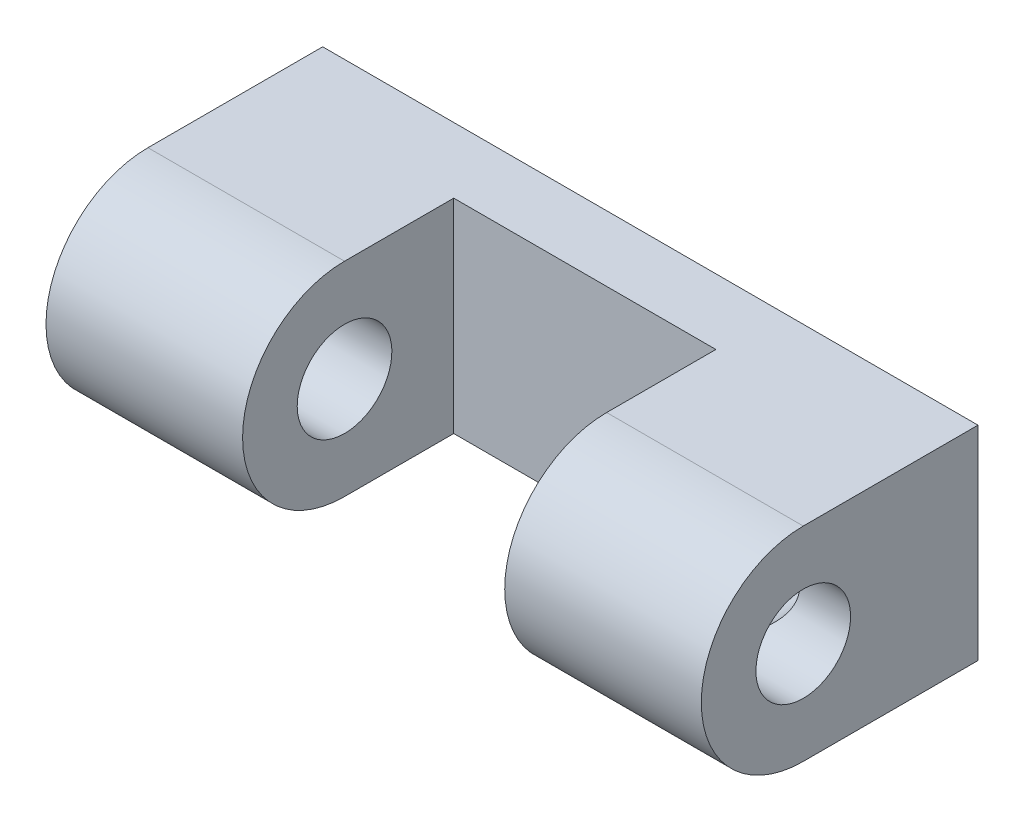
ISO-10303-21;
HEADER;
FILE_DESCRIPTION(('STEP AP214'),'2;1');
FILE_NAME('part.step','',(''),(''),'','','');
FILE_SCHEMA(('AUTOMOTIVE_DESIGN { 1 0 10303 214 1 1 1 1 }'));
ENDSEC;
DATA;
#1=APPLICATION_CONTEXT('core data for automotive mechanical design processes');
#2=APPLICATION_PROTOCOL_DEFINITION('international standard','automotive_design',2000,#1);
#3=PRODUCT_CONTEXT('',#1,'mechanical');
#4=PRODUCT('Part','Part','',(#3));
#5=PRODUCT_RELATED_PRODUCT_CATEGORY('part','',(#4));
#6=PRODUCT_DEFINITION_FORMATION('','',#4);
#7=PRODUCT_DEFINITION_CONTEXT('part definition',#1,'design');
#8=PRODUCT_DEFINITION('design','',#6,#7);
#9=PRODUCT_DEFINITION_SHAPE('','',#8);
#10=(LENGTH_UNIT() NAMED_UNIT(*) SI_UNIT(.MILLI.,.METRE.));
#11=(NAMED_UNIT(*) PLANE_ANGLE_UNIT() SI_UNIT($,.RADIAN.));
#12=(NAMED_UNIT(*) SI_UNIT($,.STERADIAN.) SOLID_ANGLE_UNIT());
#13=UNCERTAINTY_MEASURE_WITH_UNIT(LENGTH_MEASURE(1.E-05),#10,'distance_accuracy_value','');
#14=(GEOMETRIC_REPRESENTATION_CONTEXT(3) GLOBAL_UNCERTAINTY_ASSIGNED_CONTEXT((#13)) GLOBAL_UNIT_ASSIGNED_CONTEXT((#10,
#11,#12)) REPRESENTATION_CONTEXT('',''));
#15=CARTESIAN_POINT('',(0.,0.,0.));
#16=DIRECTION('',(0.,0.,1.));
#17=DIRECTION('',(1.,0.,0.));
#18=AXIS2_PLACEMENT_3D('',#15,#16,#17);
#19=CARTESIAN_POINT('',(38.5,0.,12.));
#20=DIRECTION('',(-1.,0.,0.));
#21=DIRECTION('',(0.,-1.,0.));
#22=AXIS2_PLACEMENT_3D('',#19,#20,#21);
#23=CYLINDRICAL_SURFACE('',#22,7.);
#24=CARTESIAN_POINT('',(25.,0.,12.));
#25=DIRECTION('',(-1.,0.,0.));
#26=DIRECTION('',(0.,0.,1.));
#27=AXIS2_PLACEMENT_3D('',#24,#25,#26);
#28=CIRCLE('',#27,7.);
#29=CARTESIAN_POINT('',(25.,-7.,12.));
#30=VERTEX_POINT('',#29);
#31=CARTESIAN_POINT('',(25.,7.,12.));
#32=VERTEX_POINT('',#31);
#33=EDGE_CURVE('E83',#30,#32,#28,.T.);
#34=ORIENTED_EDGE('',*,*,#33,.F.);
#35=DIRECTION('',(-1.,0.,0.));
#36=VECTOR('',#35,1.);
#37=CARTESIAN_POINT('',(38.5,-7.,12.));
#38=LINE('',#37,#36);
#39=CARTESIAN_POINT('',(38.5,-7.,12.));
#40=VERTEX_POINT('',#39);
#41=EDGE_CURVE('E10',#40,#30,#38,.T.);
#42=ORIENTED_EDGE('',*,*,#41,.F.);
#43=CARTESIAN_POINT('',(38.5,0.,12.));
#44=DIRECTION('',(1.,0.,0.));
#45=DIRECTION('',(0.,1.,0.));
#46=AXIS2_PLACEMENT_3D('',#43,#44,#45);
#47=CIRCLE('',#46,7.);
#48=CARTESIAN_POINT('',(38.5,7.,12.));
#49=VERTEX_POINT('',#48);
#50=EDGE_CURVE('E99',#49,#40,#47,.T.);
#51=ORIENTED_EDGE('',*,*,#50,.F.);
#52=DIRECTION('',(-1.,0.,0.));
#53=VECTOR('',#52,1.);
#54=CARTESIAN_POINT('',(38.5,7.,12.));
#55=LINE('',#54,#53);
#56=EDGE_CURVE('E39',#49,#32,#55,.T.);
#57=ORIENTED_EDGE('',*,*,#56,.T.);
#58=EDGE_LOOP('',(#34,#42,#51,#57));
#59=FACE_BOUND('',#58,.T.);
#60=ADVANCED_FACE('F16',(#59),#23,.T.);
#61=CARTESIAN_POINT('',(38.5,-7.,12.));
#62=DIRECTION('',(0.,1.,0.));
#63=DIRECTION('',(0.,0.,1.));
#64=AXIS2_PLACEMENT_3D('',#61,#62,#63);
#65=PLANE('',#64);
#66=DIRECTION('',(0.,0.,1.));
#67=VECTOR('',#66,1.);
#68=CARTESIAN_POINT('',(25.,-7.,4.5));
#69=LINE('',#68,#67);
#70=CARTESIAN_POINT('',(25.,-7.,4.5));
#71=VERTEX_POINT('',#70);
#72=EDGE_CURVE('E89',#71,#30,#69,.T.);
#73=ORIENTED_EDGE('',*,*,#72,.F.);
#74=DIRECTION('',(-1.,0.,0.));
#75=VECTOR('',#74,1.);
#76=CARTESIAN_POINT('',(25.,-7.,4.5));
#77=LINE('',#76,#75);
#78=CARTESIAN_POINT('',(7.,-7.,4.5));
#79=VERTEX_POINT('',#78);
#80=EDGE_CURVE('E148',#71,#79,#77,.T.);
#81=ORIENTED_EDGE('',*,*,#80,.T.);
#82=DIRECTION('',(0.,0.,1.));
#83=VECTOR('',#82,1.);
#84=CARTESIAN_POINT('',(7.,-7.,4.5));
#85=LINE('',#84,#83);
#86=CARTESIAN_POINT('',(7.,-7.,12.));
#87=VERTEX_POINT('',#86);
#88=EDGE_CURVE('E91',#79,#87,#85,.T.);
#89=ORIENTED_EDGE('',*,*,#88,.T.);
#90=CARTESIAN_POINT('',(-6.5,-7.,12.));
#91=VERTEX_POINT('',#90);
#92=EDGE_CURVE('E24',#87,#91,#38,.T.);
#93=ORIENTED_EDGE('',*,*,#92,.T.);
#94=DIRECTION('',(0.,0.,-1.));
#95=VECTOR('',#94,1.);
#96=CARTESIAN_POINT('',(-6.5,-7.,12.));
#97=LINE('',#96,#95);
#98=CARTESIAN_POINT('',(-6.5,-7.,0.));
#99=VERTEX_POINT('',#98);
#100=EDGE_CURVE('E117',#91,#99,#97,.T.);
#101=ORIENTED_EDGE('',*,*,#100,.T.);
#102=DIRECTION('',(-1.,0.,0.));
#103=VECTOR('',#102,1.);
#104=CARTESIAN_POINT('',(38.5,-7.,0.));
#105=LINE('',#104,#103);
#106=CARTESIAN_POINT('',(38.5,-7.,0.));
#107=VERTEX_POINT('',#106);
#108=EDGE_CURVE('E104',#107,#99,#105,.T.);
#109=ORIENTED_EDGE('',*,*,#108,.F.);
#110=DIRECTION('',(0.,0.,-1.));
#111=VECTOR('',#110,1.);
#112=CARTESIAN_POINT('',(38.5,-7.,12.));
#113=LINE('',#112,#111);
#114=EDGE_CURVE('E140',#40,#107,#113,.T.);
#115=ORIENTED_EDGE('',*,*,#114,.F.);
#116=ORIENTED_EDGE('',*,*,#41,.T.);
#117=EDGE_LOOP('',(#73,#81,#89,#93,#101,#109,#115,#116));
#118=FACE_BOUND('',#117,.T.);
#119=ADVANCED_FACE('F18',(#118),#65,.F.);
#120=CARTESIAN_POINT('',(38.5,7.,12.));
#121=DIRECTION('',(0.,1.,0.));
#122=DIRECTION('',(0.,0.,1.));
#123=AXIS2_PLACEMENT_3D('',#120,#121,#122);
#124=PLANE('',#123);
#125=DIRECTION('',(-1.,0.,0.));
#126=VECTOR('',#125,1.);
#127=CARTESIAN_POINT('',(25.,7.,4.5));
#128=LINE('',#127,#126);
#129=CARTESIAN_POINT('',(25.,7.,4.5));
#130=VERTEX_POINT('',#129);
#131=CARTESIAN_POINT('',(7.,7.,4.5));
#132=VERTEX_POINT('',#131);
#133=EDGE_CURVE('E95',#130,#132,#128,.T.);
#134=ORIENTED_EDGE('',*,*,#133,.F.);
#135=DIRECTION('',(0.,0.,-1.));
#136=VECTOR('',#135,1.);
#137=CARTESIAN_POINT('',(25.,7.,12.));
#138=LINE('',#137,#136);
#139=EDGE_CURVE('E86',#32,#130,#138,.T.);
#140=ORIENTED_EDGE('',*,*,#139,.F.);
#141=ORIENTED_EDGE('',*,*,#56,.F.);
#142=DIRECTION('',(0.,0.,-1.));
#143=VECTOR('',#142,1.);
#144=CARTESIAN_POINT('',(38.5,7.,12.));
#145=LINE('',#144,#143);
#146=CARTESIAN_POINT('',(38.5,7.,0.));
#147=VERTEX_POINT('',#146);
#148=EDGE_CURVE('E106',#49,#147,#145,.T.);
#149=ORIENTED_EDGE('',*,*,#148,.T.);
#150=DIRECTION('',(-1.,0.,0.));
#151=VECTOR('',#150,1.);
#152=CARTESIAN_POINT('',(38.5,7.,0.));
#153=LINE('',#152,#151);
#154=CARTESIAN_POINT('',(-6.5,7.,0.));
#155=VERTEX_POINT('',#154);
#156=EDGE_CURVE('E101',#147,#155,#153,.T.);
#157=ORIENTED_EDGE('',*,*,#156,.T.);
#158=DIRECTION('',(0.,0.,-1.));
#159=VECTOR('',#158,1.);
#160=CARTESIAN_POINT('',(-6.5,7.,12.));
#161=LINE('',#160,#159);
#162=CARTESIAN_POINT('',(-6.5,7.,12.));
#163=VERTEX_POINT('',#162);
#164=EDGE_CURVE('E134',#163,#155,#161,.T.);
#165=ORIENTED_EDGE('',*,*,#164,.F.);
#166=CARTESIAN_POINT('',(7.,7.,12.));
#167=VERTEX_POINT('',#166);
#168=EDGE_CURVE('E102',#167,#163,#55,.T.);
#169=ORIENTED_EDGE('',*,*,#168,.F.);
#170=DIRECTION('',(0.,0.,-1.));
#171=VECTOR('',#170,1.);
#172=CARTESIAN_POINT('',(7.,7.,12.));
#173=LINE('',#172,#171);
#174=EDGE_CURVE('E155',#167,#132,#173,.T.);
#175=ORIENTED_EDGE('',*,*,#174,.T.);
#176=EDGE_LOOP('',(#134,#140,#141,#149,#157,#165,#169,#175));
#177=FACE_BOUND('',#176,.T.);
#178=ADVANCED_FACE('F93',(#177),#124,.T.);
#179=CARTESIAN_POINT('',(38.5,0.,12.));
#180=DIRECTION('',(-1.,0.,0.));
#181=DIRECTION('',(0.,-1.,0.));
#182=AXIS2_PLACEMENT_3D('',#179,#180,#181);
#183=CYLINDRICAL_SURFACE('',#182,3.25);
#184=CARTESIAN_POINT('',(38.5,0.,12.));
#185=DIRECTION('',(-1.,0.,0.));
#186=DIRECTION('',(0.,-1.,0.));
#187=AXIS2_PLACEMENT_3D('',#184,#185,#186);
#188=CIRCLE('',#187,3.25);
#189=CARTESIAN_POINT('',(38.5,-3.25,12.));
#190=VERTEX_POINT('',#189);
#191=EDGE_CURVE('E129',#190,#190,#188,.T.);
#192=ORIENTED_EDGE('',*,*,#191,.F.);
#193=EDGE_LOOP('',(#192));
#194=FACE_BOUND('',#193,.T.);
#195=CARTESIAN_POINT('',(29.,0.,8.75));
#196=CARTESIAN_POINT('',(28.9999981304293,-0.0689412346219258,8.74999814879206));
#197=CARTESIAN_POINT('',(29.0023812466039,-0.137864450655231,8.7521985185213));
#198=CARTESIAN_POINT('',(29.0118484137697,-0.275116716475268,8.76093424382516));
#199=CARTESIAN_POINT('',(29.0189335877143,-0.343445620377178,8.76747063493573));
#200=CARTESIAN_POINT('',(29.0470833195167,-0.546758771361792,8.79341938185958));
#201=CARTESIAN_POINT('',(29.0750421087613,-0.680077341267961,8.81917133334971));
#202=CARTESIAN_POINT('',(29.1470544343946,-0.937275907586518,8.88526131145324));
#203=CARTESIAN_POINT('',(29.1910020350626,-1.06121168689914,8.92550331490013));
#204=CARTESIAN_POINT('',(29.2925061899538,-1.29851679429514,9.0179562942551));
#205=CARTESIAN_POINT('',(29.3500677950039,-1.4118821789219,9.07017171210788));
#206=CARTESIAN_POINT('',(29.5018887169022,-1.67035452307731,9.20687257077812));
#207=CARTESIAN_POINT('',(29.6015910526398,-1.80985632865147,9.29588497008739));
#208=CARTESIAN_POINT('',(29.8180564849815,-2.06575611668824,9.48591338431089));
#209=CARTESIAN_POINT('',(29.9348594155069,-2.18209861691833,9.58695731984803));
#210=CARTESIAN_POINT('',(30.1219699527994,-2.3409193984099,9.74426492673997));
#211=CARTESIAN_POINT('',(30.1872031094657,-2.39176754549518,9.79835962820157));
#212=CARTESIAN_POINT('',(30.321199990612,-2.48765363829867,9.90731284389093));
#213=CARTESIAN_POINT('',(30.3899629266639,-2.53269287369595,9.9621711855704));
#214=CARTESIAN_POINT('',(30.5309356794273,-2.61698037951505,10.0716133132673));
#215=CARTESIAN_POINT('',(30.6031398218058,-2.65623777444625,10.126197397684));
#216=CARTESIAN_POINT('',(30.7513543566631,-2.72904763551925,10.2339260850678));
#217=CARTESIAN_POINT('',(30.8273628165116,-2.76260296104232,10.2870713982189));
#218=CARTESIAN_POINT('',(30.981632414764,-2.82304859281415,10.3886994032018));
#219=CARTESIAN_POINT('',(31.0597714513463,-2.85009879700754,10.4372708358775));
#220=CARTESIAN_POINT('',(31.2211752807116,-2.89836672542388,10.5287311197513));
#221=CARTESIAN_POINT('',(31.3044409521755,-2.91958344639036,10.571618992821));
#222=CARTESIAN_POINT('',(31.4631071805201,-2.95249161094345,10.6411284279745));
#223=CARTESIAN_POINT('',(31.5376198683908,-2.96516607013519,10.6692566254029));
#224=CARTESIAN_POINT('',(31.69059636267,-2.98498940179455,10.7143241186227));
#225=CARTESIAN_POINT('',(31.7690452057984,-2.99215772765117,10.7313027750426));
#226=CARTESIAN_POINT('',(31.9161948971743,-2.99959247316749,10.748988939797));
#227=CARTESIAN_POINT('',(31.9845934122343,-3.00073269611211,10.751754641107));
#228=CARTESIAN_POINT('',(32.1208335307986,-2.99834099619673,10.7460233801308));
#229=CARTESIAN_POINT('',(32.1886748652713,-2.99480693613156,10.7375212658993));
#230=CARTESIAN_POINT('',(32.3435937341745,-2.98157708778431,10.7065348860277));
#231=CARTESIAN_POINT('',(32.4297732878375,-2.97025451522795,10.6804099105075));
#232=CARTESIAN_POINT('',(32.596911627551,-2.94125279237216,10.616983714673));
#233=CARTESIAN_POINT('',(32.677844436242,-2.9235444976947,10.5796313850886));
#234=CARTESIAN_POINT('',(32.8346500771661,-2.88269011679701,10.4984446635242));
#235=CARTESIAN_POINT('',(32.9105309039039,-2.85955289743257,10.4546208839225));
#236=CARTESIAN_POINT('',(33.0582670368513,-2.80823632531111,10.363215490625));
#237=CARTESIAN_POINT('',(33.1301182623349,-2.7800519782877,10.3156301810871));
#238=CARTESIAN_POINT('',(33.2704213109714,-2.71880333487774,10.2184514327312));
#239=CARTESIAN_POINT('',(33.3388688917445,-2.68573314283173,10.1688556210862));
#240=CARTESIAN_POINT('',(33.4726358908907,-2.61478012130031,10.0688898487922));
#241=CARTESIAN_POINT('',(33.5379548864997,-2.57689664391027,10.018519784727));
#242=CARTESIAN_POINT('',(33.6741559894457,-2.49088838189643,9.91114503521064));
#243=CARTESIAN_POINT('',(33.7446147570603,-2.44207153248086,9.85415341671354));
#244=CARTESIAN_POINT('',(33.8816604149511,-2.33810925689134,9.74131804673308));
#245=CARTESIAN_POINT('',(33.9482464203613,-2.28296239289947,9.68547455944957));
#246=CARTESIAN_POINT('',(34.141639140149,-2.10797679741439,9.52120041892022));
#247=CARTESIAN_POINT('',(34.2624713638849,-1.97834916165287,9.41570953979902));
#248=CARTESIAN_POINT('',(34.4580531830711,-1.72548453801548,9.24264467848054));
#249=CARTESIAN_POINT('',(34.5370090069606,-1.60763921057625,9.17193111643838));
#250=CARTESIAN_POINT('',(34.6796324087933,-1.35658960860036,9.04331757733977));
#251=CARTESIAN_POINT('',(34.7433170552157,-1.2234027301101,8.98540330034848));
#252=CARTESIAN_POINT('',(34.8430582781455,-0.965884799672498,8.89433732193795));
#253=CARTESIAN_POINT('',(34.8818985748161,-0.843516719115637,8.85871175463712));
#254=CARTESIAN_POINT('',(34.9439275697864,-0.591666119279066,8.80171016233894));
#255=CARTESIAN_POINT('',(34.9671263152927,-0.462188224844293,8.78032499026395));
#256=CARTESIAN_POINT('',(34.9963200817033,-0.199103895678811,8.7534015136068));
#257=CARTESIAN_POINT('',(35.0022451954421,-0.0654828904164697,8.74792760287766));
#258=CARTESIAN_POINT('',(34.9962240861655,0.201005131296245,8.75348534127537));
#259=CARTESIAN_POINT('',(34.984277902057,0.333872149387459,8.76451695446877));
#260=CARTESIAN_POINT('',(34.9447653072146,0.586190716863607,8.80092377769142));
#261=CARTESIAN_POINT('',(34.9182565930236,0.705954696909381,8.82532747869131));
#262=CARTESIAN_POINT('',(34.8519891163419,0.938510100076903,8.88613250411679));
#263=CARTESIAN_POINT('',(34.8122259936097,1.05129921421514,8.92253777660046));
#264=CARTESIAN_POINT('',(34.7054076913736,1.30611396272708,9.01988577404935));
#265=CARTESIAN_POINT('',(34.6336708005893,1.44460229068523,9.08495781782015));
#266=CARTESIAN_POINT('',(34.4737826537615,1.70403544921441,9.22855988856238));
#267=CARTESIAN_POINT('',(34.3855967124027,1.82494222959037,9.30711832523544));
#268=CARTESIAN_POINT('',(34.1647543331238,2.08615689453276,9.501022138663));
#269=CARTESIAN_POINT('',(34.0270530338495,2.21958285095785,9.61992269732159));
#270=CARTESIAN_POINT('',(33.8067979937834,2.39674099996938,9.80332114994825));
#271=CARTESIAN_POINT('',(33.7310239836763,2.45200158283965,9.86535133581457));
#272=CARTESIAN_POINT('',(33.5749306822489,2.55505980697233,9.98985237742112));
#273=CARTESIAN_POINT('',(33.4946132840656,2.60286052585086,10.0523230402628));
#274=CARTESIAN_POINT('',(33.3087105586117,2.70203648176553,10.1915618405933));
#275=CARTESIAN_POINT('',(33.2017921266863,2.75136725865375,10.2680410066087));
#276=CARTESIAN_POINT('',(33.0348138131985,2.81650592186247,10.3777729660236));
#277=CARTESIAN_POINT('',(32.9780849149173,2.83673448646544,10.4135021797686));
#278=CARTESIAN_POINT('',(32.8620636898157,2.87411948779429,10.4822834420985));
#279=CARTESIAN_POINT('',(32.8027726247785,2.89127741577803,10.5153367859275));
#280=CARTESIAN_POINT('',(32.6702176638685,2.92511584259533,10.5830073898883));
#281=CARTESIAN_POINT('',(32.5963666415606,2.941148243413,10.6168255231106));
#282=CARTESIAN_POINT('',(32.4442118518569,2.96792922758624,10.6752595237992));
#283=CARTESIAN_POINT('',(32.3659197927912,2.97869104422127,10.6998984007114));
#284=CARTESIAN_POINT('',(32.2200624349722,2.99264387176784,10.7323853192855));
#285=CARTESIAN_POINT('',(32.1531124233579,2.99685093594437,10.7424616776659));
#286=CARTESIAN_POINT('',(32.0183575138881,3.00069840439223,10.7516648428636));
#287=CARTESIAN_POINT('',(31.9505536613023,3.00034393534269,10.7508039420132));
#288=CARTESIAN_POINT('',(31.8163951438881,2.99512828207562,10.738356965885));
#289=CARTESIAN_POINT('',(31.7500365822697,2.99028131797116,10.7268047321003));
#290=CARTESIAN_POINT('',(31.6198373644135,2.97653870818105,10.6950062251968));
#291=CARTESIAN_POINT('',(31.5560020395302,2.96763494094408,10.6747425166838));
#292=CARTESIAN_POINT('',(31.4343731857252,2.94681064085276,10.6290869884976));
#293=CARTESIAN_POINT('',(31.376436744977,2.93505613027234,10.6039892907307));
#294=CARTESIAN_POINT('',(31.2631114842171,2.9086730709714,10.5498151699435));
#295=CARTESIAN_POINT('',(31.2077251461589,2.89404179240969,10.5207349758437));
#296=CARTESIAN_POINT('',(31.0445774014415,2.84606612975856,10.429296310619));
#297=CARTESIAN_POINT('',(30.9402522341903,2.80871693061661,10.3629211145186));
#298=CARTESIAN_POINT('',(30.7465201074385,2.72744163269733,10.231058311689));
#299=CARTESIAN_POINT('',(30.6565818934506,2.68423041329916,10.1658861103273));
#300=CARTESIAN_POINT('',(30.4819604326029,2.58948364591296,10.0343849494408));
#301=CARTESIAN_POINT('',(30.3972810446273,2.53794208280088,9.96805518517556));
#302=CARTESIAN_POINT('',(30.2331699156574,2.42654573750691,9.83624932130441));
#303=CARTESIAN_POINT('',(30.153729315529,2.36670554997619,9.77077193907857));
#304=CARTESIAN_POINT('',(30.0001660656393,2.23845234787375,9.64201531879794));
#305=CARTESIAN_POINT('',(29.9260434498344,2.17003927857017,9.57873609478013));
#306=CARTESIAN_POINT('',(29.7503901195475,1.99037444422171,9.42697330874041));
#307=CARTESIAN_POINT('',(29.6522116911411,1.87403037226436,9.34050891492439));
#308=CARTESIAN_POINT('',(29.4716825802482,1.62219518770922,9.17985542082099));
#309=CARTESIAN_POINT('',(29.3893075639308,1.48673407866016,9.1056474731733));
#310=CARTESIAN_POINT('',(29.2591089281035,1.22648956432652,8.98762699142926));
#311=CARTESIAN_POINT('',(29.2076719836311,1.10493913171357,8.94070461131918));
#312=CARTESIAN_POINT('',(29.1204468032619,0.852039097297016,8.8608894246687));
#313=CARTESIAN_POINT('',(29.0846328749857,0.720706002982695,8.82797358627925));
#314=CARTESIAN_POINT('',(29.0387991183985,0.490704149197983,8.78578809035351));
#315=CARTESIAN_POINT('',(29.0243062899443,0.393648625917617,8.77242503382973));
#316=CARTESIAN_POINT('',(29.0049075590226,0.197716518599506,8.75453184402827));
#317=CARTESIAN_POINT('',(29.0000026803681,0.098839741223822,8.75000265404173));
#318=CARTESIAN_POINT('',(29.,0.,8.75));
#319=B_SPLINE_CURVE_WITH_KNOTS('',3,(#195,#196,#197,#198,#199,#200,#201,#202,#203,#204,#205,
#206,#207,#208,#209,#210,#211,#212,#213,#214,#215,#216,#217,#218,#219,#220,#221,#222,#223,#224,
#225,#226,#227,#228,#229,#230,#231,#232,#233,#234,#235,#236,#237,#238,#239,#240,#241,#242,#243,
#244,#245,#246,#247,#248,#249,#250,#251,#252,#253,#254,#255,#256,#257,#258,#259,#260,#261,#262,
#263,#264,#265,#266,#267,#268,#269,#270,#271,#272,#273,#274,#275,#276,#277,#278,#279,#280,#281,
#282,#283,#284,#285,#286,#287,#288,#289,#290,#291,#292,#293,#294,#295,#296,#297,#298,#299,#300,
#301,#302,#303,#304,#305,#306,#307,#308,#309,#310,#311,#312,#313,#314,#315,#316,#317,#318),
.UNSPECIFIED.,.T.,.F.,(4,2,2,2,2,2,2,2,2,2,2,2,2,2,2,2,2,2,2,2,2,2,2,2,2,2,2,2,2,2,2,2,2,2,2,2,
2,2,2,2,2,2,2,2,2,2,2,2,2,2,2,2,2,2,2,2,2,2,2,2,2,4),(0.,0.206709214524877,0.413467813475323,
0.826961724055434,1.23776444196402,1.64871980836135,2.22518986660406,2.80302476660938,
3.09931979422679,3.39554892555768,3.69130544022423,3.98691320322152,4.27426957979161,
4.56167534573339,4.80287220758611,5.04321294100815,5.24751244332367,5.45190538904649,
5.72259430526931,5.99453461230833,6.26603382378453,6.53780319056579,6.80990321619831,
7.08203990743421,7.39054996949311,7.6991302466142,8.31462954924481,8.7885153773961,
9.26186905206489,9.65990369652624,10.0576824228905,10.457068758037,10.8564542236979,
11.2300678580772,11.6038045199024,12.1079981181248,12.613267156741,13.2862545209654,
13.6233344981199,13.9602750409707,14.3806261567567,14.5905873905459,14.8004463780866,
15.0482764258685,15.2954809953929,15.4980553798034,15.7004021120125,15.9021105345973,
16.1042245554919,16.2966004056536,16.4891596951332,16.8756700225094,17.2328274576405,
17.5902439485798,17.9470396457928,18.3038376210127,18.8271453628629,19.3496407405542,
19.7682388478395,20.1861459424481,20.4824693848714,20.7788244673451),.UNSPECIFIED.);
#320=CARTESIAN_POINT('',(29.,0.,8.75));
#321=VERTEX_POINT('',#320);
#322=EDGE_CURVE('E160',#321,#321,#319,.T.);
#323=ORIENTED_EDGE('',*,*,#322,.F.);
#324=EDGE_LOOP('',(#323));
#325=FACE_BOUND('',#324,.T.);
#326=CARTESIAN_POINT('',(25.,0.,12.));
#327=DIRECTION('',(-1.,0.,0.));
#328=DIRECTION('',(0.,0.,1.));
#329=AXIS2_PLACEMENT_3D('',#326,#327,#328);
#330=CIRCLE('',#329,3.25);
#331=CARTESIAN_POINT('',(25.,0.,15.25));
#332=VERTEX_POINT('',#331);
#333=EDGE_CURVE('E156',#332,#332,#330,.T.);
#334=ORIENTED_EDGE('',*,*,#333,.T.);
#335=EDGE_LOOP('',(#334));
#336=FACE_BOUND('',#335,.T.);
#337=ADVANCED_FACE('F205',(#194,#325,#336),#183,.F.);
#338=ORIENTED_EDGE('',*,*,#92,.F.);
#339=CARTESIAN_POINT('',(7.,0.,12.));
#340=DIRECTION('',(-1.,0.,0.));
#341=DIRECTION('',(0.,0.,1.));
#342=AXIS2_PLACEMENT_3D('',#339,#340,#341);
#343=CIRCLE('',#342,7.);
#344=EDGE_CURVE('E153',#87,#167,#343,.T.);
#345=ORIENTED_EDGE('',*,*,#344,.T.);
#346=ORIENTED_EDGE('',*,*,#168,.T.);
#347=CARTESIAN_POINT('',(-6.5,0.,12.));
#348=DIRECTION('',(1.,0.,0.));
#349=DIRECTION('',(0.,1.,0.));
#350=AXIS2_PLACEMENT_3D('',#347,#348,#349);
#351=CIRCLE('',#350,7.);
#352=EDGE_CURVE('E123',#163,#91,#351,.T.);
#353=ORIENTED_EDGE('',*,*,#352,.T.);
#354=EDGE_LOOP('',(#338,#345,#346,#353));
#355=FACE_BOUND('',#354,.T.);
#356=ADVANCED_FACE('F124',(#355),#23,.T.);
#357=CARTESIAN_POINT('',(38.5,7.,0.));
#358=DIRECTION('',(0.,0.,-1.));
#359=DIRECTION('',(-1.,0.,0.));
#360=AXIS2_PLACEMENT_3D('',#357,#358,#359);
#361=PLANE('',#360);
#362=ORIENTED_EDGE('',*,*,#156,.F.);
#363=DIRECTION('',(0.,-1.,0.));
#364=VECTOR('',#363,1.);
#365=CARTESIAN_POINT('',(38.5,7.,0.));
#366=LINE('',#365,#364);
#367=EDGE_CURVE('E142',#147,#107,#366,.T.);
#368=ORIENTED_EDGE('',*,*,#367,.T.);
#369=ORIENTED_EDGE('',*,*,#108,.T.);
#370=DIRECTION('',(0.,-1.,0.));
#371=VECTOR('',#370,1.);
#372=CARTESIAN_POINT('',(-6.5,7.,0.));
#373=LINE('',#372,#371);
#374=EDGE_CURVE('E132',#155,#99,#373,.T.);
#375=ORIENTED_EDGE('',*,*,#374,.F.);
#376=EDGE_LOOP('',(#362,#368,#369,#375));
#377=FACE_BOUND('',#376,.T.);
#378=CARTESIAN_POINT('',(0.,0.,0.));
#379=DIRECTION('',(0.,0.,-1.));
#380=DIRECTION('',(-1.,0.,0.));
#381=AXIS2_PLACEMENT_3D('',#378,#379,#380);
#382=CIRCLE('',#381,3.);
#383=CARTESIAN_POINT('',(-3.,0.,0.));
#384=VERTEX_POINT('',#383);
#385=EDGE_CURVE('E243',#384,#384,#382,.T.);
#386=ORIENTED_EDGE('',*,*,#385,.F.);
#387=EDGE_LOOP('',(#386));
#388=FACE_BOUND('',#387,.T.);
#389=CARTESIAN_POINT('',(32.,0.,0.));
#390=DIRECTION('',(0.,0.,-1.));
#391=DIRECTION('',(-1.,0.,0.));
#392=AXIS2_PLACEMENT_3D('',#389,#390,#391);
#393=CIRCLE('',#392,3.);
#394=CARTESIAN_POINT('',(29.,0.,0.));
#395=VERTEX_POINT('',#394);
#396=EDGE_CURVE('E241',#395,#395,#393,.T.);
#397=ORIENTED_EDGE('',*,*,#396,.F.);
#398=EDGE_LOOP('',(#397));
#399=FACE_BOUND('',#398,.T.);
#400=ADVANCED_FACE('F204',(#377,#388,#399),#361,.T.);
#401=CARTESIAN_POINT('',(38.5,0.,12.));
#402=DIRECTION('',(1.,0.,0.));
#403=DIRECTION('',(0.,1.,0.));
#404=AXIS2_PLACEMENT_3D('',#401,#402,#403);
#405=PLANE('',#404);
#406=ORIENTED_EDGE('',*,*,#191,.T.);
#407=EDGE_LOOP('',(#406));
#408=FACE_BOUND('',#407,.T.);
#409=ORIENTED_EDGE('',*,*,#50,.T.);
#410=ORIENTED_EDGE('',*,*,#114,.T.);
#411=ORIENTED_EDGE('',*,*,#367,.F.);
#412=ORIENTED_EDGE('',*,*,#148,.F.);
#413=EDGE_LOOP('',(#409,#410,#411,#412));
#414=FACE_BOUND('',#413,.T.);
#415=ADVANCED_FACE('F146',(#408,#414),#405,.T.);
#416=CARTESIAN_POINT('',(-6.5,0.,12.));
#417=DIRECTION('',(1.,0.,0.));
#418=DIRECTION('',(0.,1.,0.));
#419=AXIS2_PLACEMENT_3D('',#416,#417,#418);
#420=PLANE('',#419);
#421=CARTESIAN_POINT('',(-6.5,0.,12.));
#422=DIRECTION('',(-1.,0.,0.));
#423=DIRECTION('',(0.,-1.,0.));
#424=AXIS2_PLACEMENT_3D('',#421,#422,#423);
#425=CIRCLE('',#424,3.25);
#426=CARTESIAN_POINT('',(-6.5,-3.25,12.));
#427=VERTEX_POINT('',#426);
#428=EDGE_CURVE('E238',#427,#427,#425,.T.);
#429=ORIENTED_EDGE('',*,*,#428,.F.);
#430=EDGE_LOOP('',(#429));
#431=FACE_BOUND('',#430,.T.);
#432=ORIENTED_EDGE('',*,*,#352,.F.);
#433=ORIENTED_EDGE('',*,*,#164,.T.);
#434=ORIENTED_EDGE('',*,*,#374,.T.);
#435=ORIENTED_EDGE('',*,*,#100,.F.);
#436=EDGE_LOOP('',(#432,#433,#434,#435));
#437=FACE_BOUND('',#436,.T.);
#438=ADVANCED_FACE('F131',(#431,#437),#420,.F.);
#439=CARTESIAN_POINT('',(7.,0.,12.));
#440=DIRECTION('',(-1.,0.,0.));
#441=DIRECTION('',(0.,0.,1.));
#442=AXIS2_PLACEMENT_3D('',#439,#440,#441);
#443=CIRCLE('',#442,3.25);
#444=CARTESIAN_POINT('',(7.,0.,15.25));
#445=VERTEX_POINT('',#444);
#446=EDGE_CURVE('E234',#445,#445,#443,.T.);
#447=ORIENTED_EDGE('',*,*,#446,.F.);
#448=EDGE_LOOP('',(#447));
#449=FACE_BOUND('',#448,.T.);
#450=ORIENTED_EDGE('',*,*,#428,.T.);
#451=EDGE_LOOP('',(#450));
#452=FACE_BOUND('',#451,.T.);
#453=CARTESIAN_POINT('',(-3.,0.,8.75));
#454=CARTESIAN_POINT('',(-3.00000186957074,-0.0689412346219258,8.74999814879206));
#455=CARTESIAN_POINT('',(-2.99761875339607,-0.137864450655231,8.7521985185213));
#456=CARTESIAN_POINT('',(-2.98815158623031,-0.275116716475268,8.76093424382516));
#457=CARTESIAN_POINT('',(-2.98106641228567,-0.343445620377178,8.76747063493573));
#458=CARTESIAN_POINT('',(-2.95291668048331,-0.546758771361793,8.79341938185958));
#459=CARTESIAN_POINT('',(-2.92495789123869,-0.680077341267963,8.8191713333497));
#460=CARTESIAN_POINT('',(-2.85294556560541,-0.93727590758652,8.88526131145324));
#461=CARTESIAN_POINT('',(-2.80899796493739,-1.06121168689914,8.92550331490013));
#462=CARTESIAN_POINT('',(-2.70749381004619,-1.29851679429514,9.01795629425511));
#463=CARTESIAN_POINT('',(-2.64993220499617,-1.4118821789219,9.07017171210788));
#464=CARTESIAN_POINT('',(-2.49811128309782,-1.67035452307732,9.20687257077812));
#465=CARTESIAN_POINT('',(-2.39840894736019,-1.80985632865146,9.29588497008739));
#466=CARTESIAN_POINT('',(-2.18194351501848,-2.06575611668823,9.48591338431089));
#467=CARTESIAN_POINT('',(-2.06514058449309,-2.18209861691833,9.58695731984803));
#468=CARTESIAN_POINT('',(-1.87803004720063,-2.3409193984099,9.74426492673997));
#469=CARTESIAN_POINT('',(-1.81279689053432,-2.39176754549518,9.79835962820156));
#470=CARTESIAN_POINT('',(-1.67880000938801,-2.48765363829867,9.90731284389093));
#471=CARTESIAN_POINT('',(-1.61003707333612,-2.53269287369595,9.9621711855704));
#472=CARTESIAN_POINT('',(-1.4690643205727,-2.61698037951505,10.0716133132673));
#473=CARTESIAN_POINT('',(-1.39686017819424,-2.65623777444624,10.126197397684));
#474=CARTESIAN_POINT('',(-1.2486456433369,-2.72904763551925,10.2339260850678));
#475=CARTESIAN_POINT('',(-1.17263718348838,-2.76260296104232,10.2870713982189));
#476=CARTESIAN_POINT('',(-1.01836758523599,-2.82304859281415,10.3886994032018));
#477=CARTESIAN_POINT('',(-0.940228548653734,-2.85009879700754,10.4372708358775));
#478=CARTESIAN_POINT('',(-0.778824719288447,-2.89836672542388,10.5287311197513));
#479=CARTESIAN_POINT('',(-0.695559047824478,-2.91958344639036,10.571618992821));
#480=CARTESIAN_POINT('',(-0.536892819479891,-2.95249161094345,10.6411284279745));
#481=CARTESIAN_POINT('',(-0.462380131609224,-2.96516607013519,10.6692566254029));
#482=CARTESIAN_POINT('',(-0.309403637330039,-2.98498940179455,10.7143241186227));
#483=CARTESIAN_POINT('',(-0.230954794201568,-2.99215772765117,10.7313027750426));
#484=CARTESIAN_POINT('',(-0.0838051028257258,-2.99959247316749,10.748988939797));
#485=CARTESIAN_POINT('',(-0.0154065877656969,-3.00073269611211,10.751754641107));
#486=CARTESIAN_POINT('',(0.120833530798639,-2.99834099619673,10.7460233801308));
#487=CARTESIAN_POINT('',(0.18867486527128,-2.99480693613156,10.7375212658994));
#488=CARTESIAN_POINT('',(0.343593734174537,-2.98157708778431,10.7065348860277));
#489=CARTESIAN_POINT('',(0.429773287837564,-2.97025451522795,10.6804099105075));
#490=CARTESIAN_POINT('',(0.596911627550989,-2.94125279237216,10.616983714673));
#491=CARTESIAN_POINT('',(0.677844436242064,-2.9235444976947,10.5796313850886));
#492=CARTESIAN_POINT('',(0.834650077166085,-2.88269011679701,10.4984446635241));
#493=CARTESIAN_POINT('',(0.910530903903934,-2.85955289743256,10.4546208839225));
#494=CARTESIAN_POINT('',(1.0582670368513,-2.80823632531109,10.363215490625));
#495=CARTESIAN_POINT('',(1.13011826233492,-2.78005197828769,10.3156301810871));
#496=CARTESIAN_POINT('',(1.27042131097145,-2.71880333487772,10.2184514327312));
#497=CARTESIAN_POINT('',(1.33886889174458,-2.68573314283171,10.1688556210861));
#498=CARTESIAN_POINT('',(1.47263589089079,-2.61478012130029,10.0688898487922));
#499=CARTESIAN_POINT('',(1.53795488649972,-2.57689664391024,10.0185197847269));
#500=CARTESIAN_POINT('',(1.67415598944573,-2.49088838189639,9.91114503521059));
#501=CARTESIAN_POINT('',(1.74461475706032,-2.44207153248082,9.85415341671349));
#502=CARTESIAN_POINT('',(1.88166041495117,-2.3381092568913,9.74131804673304));
#503=CARTESIAN_POINT('',(1.94824642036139,-2.28296239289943,9.68547455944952));
#504=CARTESIAN_POINT('',(2.14163914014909,-2.10797679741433,9.52120041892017));
#505=CARTESIAN_POINT('',(2.26247136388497,-1.97834916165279,9.41570953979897));
#506=CARTESIAN_POINT('',(2.45805318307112,-1.7254845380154,9.2426446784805));
#507=CARTESIAN_POINT('',(2.53700900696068,-1.60763921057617,9.17193111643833));
#508=CARTESIAN_POINT('',(2.67963240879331,-1.35658960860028,9.04331757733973));
#509=CARTESIAN_POINT('',(2.74331705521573,-1.22340273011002,8.98540330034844));
#510=CARTESIAN_POINT('',(2.84305827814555,-0.965884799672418,8.89433732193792));
#511=CARTESIAN_POINT('',(2.88189857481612,-0.843516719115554,8.8587117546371));
#512=CARTESIAN_POINT('',(2.94392756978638,-0.591666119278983,8.80171016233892));
#513=CARTESIAN_POINT('',(2.96712631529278,-0.462188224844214,8.78032499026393));
#514=CARTESIAN_POINT('',(2.99632008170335,-0.199103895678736,8.75340151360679));
#515=CARTESIAN_POINT('',(3.00224519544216,-0.0654828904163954,8.74792760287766));
#516=CARTESIAN_POINT('',(2.99622408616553,0.201005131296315,8.75348534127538));
#517=CARTESIAN_POINT('',(2.98427790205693,0.333872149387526,8.76451695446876));
#518=CARTESIAN_POINT('',(2.94476530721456,0.586190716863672,8.80092377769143));
#519=CARTESIAN_POINT('',(2.91825659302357,0.705954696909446,8.82532747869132));
#520=CARTESIAN_POINT('',(2.85198911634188,0.938510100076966,8.88613250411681));
#521=CARTESIAN_POINT('',(2.81222599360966,1.0512992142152,8.92253777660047));
#522=CARTESIAN_POINT('',(2.70540769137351,1.30611396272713,9.01988577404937));
#523=CARTESIAN_POINT('',(2.6336708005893,1.44460229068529,9.08495781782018));
#524=CARTESIAN_POINT('',(2.47378265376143,1.70403544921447,9.22855988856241));
#525=CARTESIAN_POINT('',(2.38559671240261,1.82494222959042,9.30711832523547));
#526=CARTESIAN_POINT('',(2.16475433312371,2.08615689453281,9.50102213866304));
#527=CARTESIAN_POINT('',(2.02705303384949,2.2195828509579,9.61992269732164));
#528=CARTESIAN_POINT('',(1.80679799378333,2.39674099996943,9.8033211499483));
#529=CARTESIAN_POINT('',(1.73102398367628,2.45200158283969,9.86535133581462));
#530=CARTESIAN_POINT('',(1.57493068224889,2.55505980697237,9.98985237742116));
#531=CARTESIAN_POINT('',(1.49461328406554,2.60286052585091,10.0523230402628));
#532=CARTESIAN_POINT('',(1.30871055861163,2.70203648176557,10.1915618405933));
#533=CARTESIAN_POINT('',(1.20179212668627,2.75136725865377,10.2680410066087));
#534=CARTESIAN_POINT('',(1.03481381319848,2.81650592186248,10.3777729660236));
#535=CARTESIAN_POINT('',(0.978084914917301,2.83673448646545,10.4135021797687));
#536=CARTESIAN_POINT('',(0.862063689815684,2.8741194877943,10.4822834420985));
#537=CARTESIAN_POINT('',(0.802772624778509,2.89127741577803,10.5153367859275));
#538=CARTESIAN_POINT('',(0.67021766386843,2.92511584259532,10.5830073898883));
#539=CARTESIAN_POINT('',(0.596366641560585,2.941148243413,10.6168255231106));
#540=CARTESIAN_POINT('',(0.444211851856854,2.96792922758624,10.6752595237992));
#541=CARTESIAN_POINT('',(0.365919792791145,2.97869104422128,10.6998984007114));
#542=CARTESIAN_POINT('',(0.220062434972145,2.99264387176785,10.7323853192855));
#543=CARTESIAN_POINT('',(0.15311242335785,2.99685093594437,10.7424616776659));
#544=CARTESIAN_POINT('',(0.0183575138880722,3.00069840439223,10.7516648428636));
#545=CARTESIAN_POINT('',(-0.0494463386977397,3.00034393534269,10.7508039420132));
#546=CARTESIAN_POINT('',(-0.183604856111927,2.99512828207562,10.738356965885));
#547=CARTESIAN_POINT('',(-0.24996341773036,2.99028131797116,10.7268047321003));
#548=CARTESIAN_POINT('',(-0.380162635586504,2.97653870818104,10.6950062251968));
#549=CARTESIAN_POINT('',(-0.443997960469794,2.96763494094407,10.6747425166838));
#550=CARTESIAN_POINT('',(-0.565626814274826,2.94681064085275,10.6290869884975));
#551=CARTESIAN_POINT('',(-0.62356325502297,2.93505613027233,10.6039892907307));
#552=CARTESIAN_POINT('',(-0.736888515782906,2.9086730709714,10.5498151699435));
#553=CARTESIAN_POINT('',(-0.792274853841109,2.89404179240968,10.5207349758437));
#554=CARTESIAN_POINT('',(-0.955422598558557,2.84606612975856,10.429296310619));
#555=CARTESIAN_POINT('',(-1.05974776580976,2.8087169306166,10.3629211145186));
#556=CARTESIAN_POINT('',(-1.25347989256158,2.72744163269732,10.231058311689));
#557=CARTESIAN_POINT('',(-1.34341810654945,2.68423041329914,10.1658861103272));
#558=CARTESIAN_POINT('',(-1.5180395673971,2.58948364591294,10.0343849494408));
#559=CARTESIAN_POINT('',(-1.60271895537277,2.53794208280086,9.96805518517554));
#560=CARTESIAN_POINT('',(-1.76683008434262,2.42654573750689,9.83624932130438));
#561=CARTESIAN_POINT('',(-1.84627068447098,2.36670554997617,9.77077193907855));
#562=CARTESIAN_POINT('',(-1.99983393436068,2.23845234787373,9.64201531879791));
#563=CARTESIAN_POINT('',(-2.07395655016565,2.17003927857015,9.57873609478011));
#564=CARTESIAN_POINT('',(-2.24960988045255,1.99037444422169,9.42697330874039));
#565=CARTESIAN_POINT('',(-2.34778830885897,1.87403037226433,9.34050891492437));
#566=CARTESIAN_POINT('',(-2.5283174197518,1.6221951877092,9.17985542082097));
#567=CARTESIAN_POINT('',(-2.61069243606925,1.48673407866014,9.10564747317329));
#568=CARTESIAN_POINT('',(-2.74089107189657,1.2264895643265,8.98762699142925));
#569=CARTESIAN_POINT('',(-2.79232801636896,1.10493913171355,8.94070461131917));
#570=CARTESIAN_POINT('',(-2.8795531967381,0.852039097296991,8.86088942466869));
#571=CARTESIAN_POINT('',(-2.91536712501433,0.720706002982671,8.82797358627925));
#572=CARTESIAN_POINT('',(-2.96120088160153,0.490704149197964,8.78578809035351));
#573=CARTESIAN_POINT('',(-2.97569371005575,0.393648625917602,8.77242503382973));
#574=CARTESIAN_POINT('',(-2.99509244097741,0.197716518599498,8.75453184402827));
#575=CARTESIAN_POINT('',(-2.99999731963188,0.098839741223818,8.75000265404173));
#576=CARTESIAN_POINT('',(-3.,0.,8.75));
#577=B_SPLINE_CURVE_WITH_KNOTS('',3,(#453,#454,#455,#456,#457,#458,#459,#460,#461,#462,#463,
#464,#465,#466,#467,#468,#469,#470,#471,#472,#473,#474,#475,#476,#477,#478,#479,#480,#481,#482,
#483,#484,#485,#486,#487,#488,#489,#490,#491,#492,#493,#494,#495,#496,#497,#498,#499,#500,#501,
#502,#503,#504,#505,#506,#507,#508,#509,#510,#511,#512,#513,#514,#515,#516,#517,#518,#519,#520,
#521,#522,#523,#524,#525,#526,#527,#528,#529,#530,#531,#532,#533,#534,#535,#536,#537,#538,#539,
#540,#541,#542,#543,#544,#545,#546,#547,#548,#549,#550,#551,#552,#553,#554,#555,#556,#557,#558,
#559,#560,#561,#562,#563,#564,#565,#566,#567,#568,#569,#570,#571,#572,#573,#574,#575,#576),
.UNSPECIFIED.,.T.,.F.,(4,2,2,2,2,2,2,2,2,2,2,2,2,2,2,2,2,2,2,2,2,2,2,2,2,2,2,2,2,2,2,2,2,2,2,2,
2,2,2,2,2,2,2,2,2,2,2,2,2,2,2,2,2,2,2,2,2,2,2,2,2,4),(0.,0.206709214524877,0.413467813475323,
0.826961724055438,1.23776444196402,1.64871980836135,2.22518986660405,2.80302476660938,
3.09931979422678,3.39554892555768,3.69130544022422,3.98691320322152,4.2742695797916,
4.56167534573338,4.8028722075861,5.04321294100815,5.24751244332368,5.45190538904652,
5.72259430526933,5.99453461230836,6.26603382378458,6.53780319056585,6.80990321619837,
7.08203990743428,7.39054996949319,7.69913024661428,8.31462954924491,8.7885153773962,
9.26186905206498,9.65990369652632,10.0576824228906,10.4570687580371,10.8564542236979,
11.2300678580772,11.6038045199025,12.1079981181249,12.6132671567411,13.2862545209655,
13.6233344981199,13.9602750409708,14.3806261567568,14.5905873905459,14.8004463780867,
15.0482764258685,15.2954809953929,15.4980553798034,15.7004021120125,15.9021105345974,
16.1042245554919,16.2966004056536,16.4891596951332,16.8756700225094,17.2328274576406,
17.5902439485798,17.9470396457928,18.3038376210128,18.827145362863,19.3496407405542,
19.7682388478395,20.1861459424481,20.4824693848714,20.7788244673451),.UNSPECIFIED.);
#578=CARTESIAN_POINT('',(-3.,0.,8.75));
#579=VERTEX_POINT('',#578);
#580=EDGE_CURVE('E169',#579,#579,#577,.T.);
#581=ORIENTED_EDGE('',*,*,#580,.F.);
#582=EDGE_LOOP('',(#581));
#583=FACE_BOUND('',#582,.T.);
#584=ADVANCED_FACE('F213',(#449,#452,#583),#183,.F.);
#585=CARTESIAN_POINT('',(0.,0.,12.));
#586=DIRECTION('',(0.,0.,-1.));
#587=DIRECTION('',(-1.,0.,0.));
#588=AXIS2_PLACEMENT_3D('',#585,#586,#587);
#589=CYLINDRICAL_SURFACE('',#588,3.);
#590=ORIENTED_EDGE('',*,*,#580,.T.);
#591=EDGE_LOOP('',(#590));
#592=FACE_BOUND('',#591,.T.);
#593=ORIENTED_EDGE('',*,*,#385,.T.);
#594=EDGE_LOOP('',(#593));
#595=FACE_BOUND('',#594,.T.);
#596=ADVANCED_FACE('F222',(#592,#595),#589,.F.);
#597=CARTESIAN_POINT('',(32.,0.,12.));
#598=DIRECTION('',(0.,0.,-1.));
#599=DIRECTION('',(-1.,0.,0.));
#600=AXIS2_PLACEMENT_3D('',#597,#598,#599);
#601=CYLINDRICAL_SURFACE('',#600,3.);
#602=ORIENTED_EDGE('',*,*,#322,.T.);
#603=EDGE_LOOP('',(#602));
#604=FACE_BOUND('',#603,.T.);
#605=ORIENTED_EDGE('',*,*,#396,.T.);
#606=EDGE_LOOP('',(#605));
#607=FACE_BOUND('',#606,.T.);
#608=ADVANCED_FACE('F175',(#604,#607),#601,.F.);
#609=CARTESIAN_POINT('',(25.,7.,4.5));
#610=DIRECTION('',(0.,0.,-1.));
#611=DIRECTION('',(-1.,0.,0.));
#612=AXIS2_PLACEMENT_3D('',#609,#610,#611);
#613=PLANE('',#612);
#614=DIRECTION('',(0.,-1.,0.));
#615=VECTOR('',#614,1.);
#616=CARTESIAN_POINT('',(7.,7.,4.5));
#617=LINE('',#616,#615);
#618=EDGE_CURVE('E31',#132,#79,#617,.T.);
#619=ORIENTED_EDGE('',*,*,#618,.T.);
#620=ORIENTED_EDGE('',*,*,#80,.F.);
#621=DIRECTION('',(0.,-1.,0.));
#622=VECTOR('',#621,1.);
#623=CARTESIAN_POINT('',(25.,7.,4.5));
#624=LINE('',#623,#622);
#625=EDGE_CURVE('E96',#130,#71,#624,.T.);
#626=ORIENTED_EDGE('',*,*,#625,.F.);
#627=ORIENTED_EDGE('',*,*,#133,.T.);
#628=EDGE_LOOP('',(#619,#620,#626,#627));
#629=FACE_BOUND('',#628,.T.);
#630=ADVANCED_FACE('F179',(#629),#613,.F.);
#631=CARTESIAN_POINT('',(25.,0.,12.));
#632=DIRECTION('',(-1.,0.,0.));
#633=DIRECTION('',(0.,0.,1.));
#634=AXIS2_PLACEMENT_3D('',#631,#632,#633);
#635=PLANE('',#634);
#636=ORIENTED_EDGE('',*,*,#333,.F.);
#637=EDGE_LOOP('',(#636));
#638=FACE_BOUND('',#637,.T.);
#639=ORIENTED_EDGE('',*,*,#33,.T.);
#640=ORIENTED_EDGE('',*,*,#139,.T.);
#641=ORIENTED_EDGE('',*,*,#625,.T.);
#642=ORIENTED_EDGE('',*,*,#72,.T.);
#643=EDGE_LOOP('',(#639,#640,#641,#642));
#644=FACE_BOUND('',#643,.T.);
#645=ADVANCED_FACE('F84',(#638,#644),#635,.T.);
#646=CARTESIAN_POINT('',(7.,0.,12.));
#647=DIRECTION('',(-1.,0.,0.));
#648=DIRECTION('',(0.,0.,1.));
#649=AXIS2_PLACEMENT_3D('',#646,#647,#648);
#650=PLANE('',#649);
#651=ORIENTED_EDGE('',*,*,#446,.T.);
#652=EDGE_LOOP('',(#651));
#653=FACE_BOUND('',#652,.T.);
#654=ORIENTED_EDGE('',*,*,#344,.F.);
#655=ORIENTED_EDGE('',*,*,#88,.F.);
#656=ORIENTED_EDGE('',*,*,#618,.F.);
#657=ORIENTED_EDGE('',*,*,#174,.F.);
#658=EDGE_LOOP('',(#654,#655,#656,#657));
#659=FACE_BOUND('',#658,.T.);
#660=ADVANCED_FACE('F184',(#653,#659),#650,.F.);
#661=CLOSED_SHELL('',(#60,#119,#178,#337,#356,#400,#415,#438,#584,#596,#608,#630,#645,#660));
#662=MANIFOLD_SOLID_BREP('B1',#661);
#663=ADVANCED_BREP_SHAPE_REPRESENTATION('',(#18,#662),#14);
#664=SHAPE_DEFINITION_REPRESENTATION(#9,#663);
ENDSEC;
END-ISO-10303-21;
